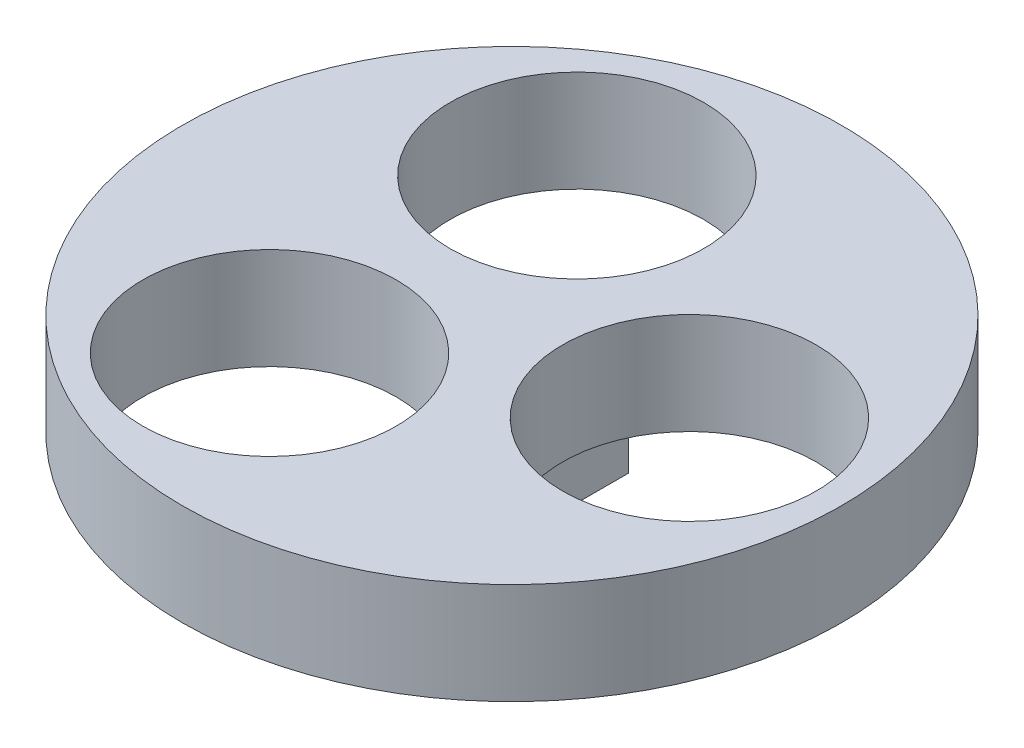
from build123d import *

# Parameters (mm, degrees)
ESQUISSE1_R      = 6.5
ESQUISSE1_R_2    = 2.5
EXTRUSION1_DEPTH = 2
EXTRUSION2_DEPTH = 1


with BuildPart() as part:
    # Esquisse1 → Extrusion1 (new body)
    with BuildSketch(Plane(origin=(0, 0, 0), x_dir=(1, 0, 0), z_dir=(0, 1, 0))):
        with Locations(Location((0, 0, 0), (0, 0, 270))):
            Circle(ESQUISSE1_R)
        with Locations(Location((3.5, 0, 0), (0, 0, 270))):
            Circle(ESQUISSE1_R_2, mode=Mode.SUBTRACT)
        with Locations(Location((-1.75, -3.031088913, 0), (0, 0, 270))):
            Circle(ESQUISSE1_R_2, mode=Mode.SUBTRACT)
        with Locations(Location((-1.75, 3.031088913, 0), (0, 0, 270))):
            Circle(ESQUISSE1_R_2, mode=Mode.SUBTRACT)
    extrude(amount=EXTRUSION1_DEPTH)

    # Esquisse2 → Extrusion2 (add)
    with BuildSketch(Plane(origin=(0, 0, 0), x_dir=(-1, 0, 0), z_dir=(0, 1, 0))):
        Polygon((-0.842949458, -1.46003129), (-0.842949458, 1.46003129), (1.685898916, 0), align=None)
    extrude(amount=-EXTRUSION2_DEPTH)


solid = part.part
